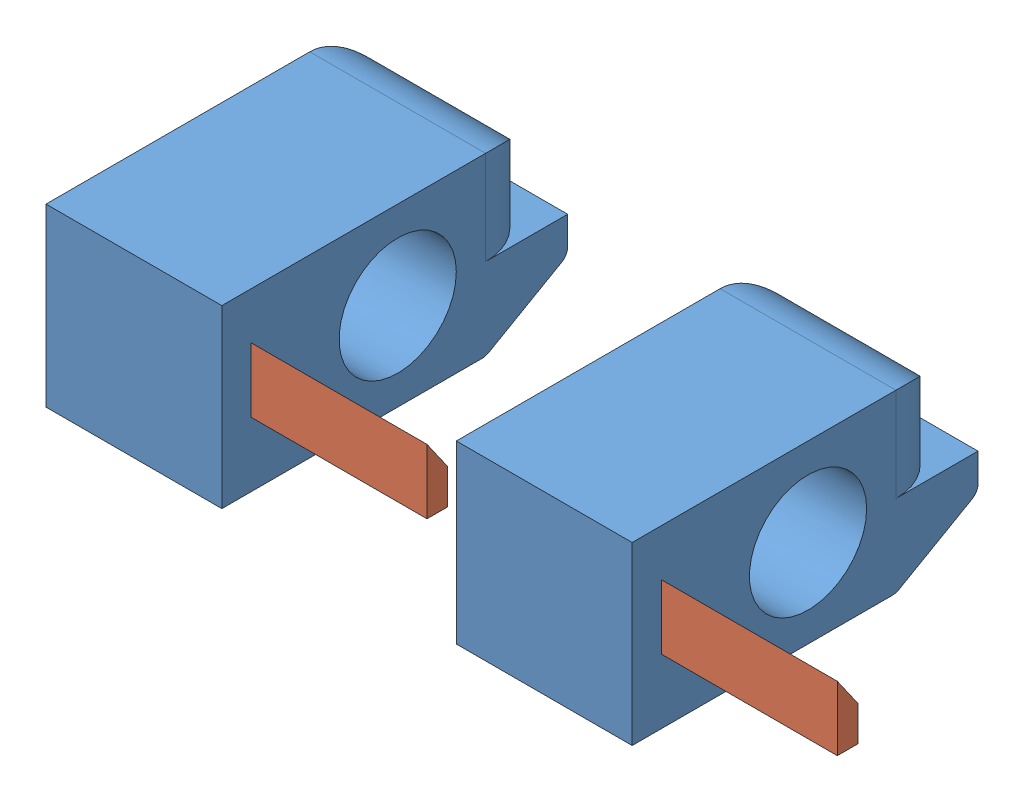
SolidWorks assembly linkageAssembly.SLDASM, configuration Default (file format 19000). Lengths in mm.
Overall size (13.5 3 5.9).
4 component instances, 2 part files, 9 mates.
Components (placement in the parent):
- oneLink-1: oneLink.SLDPRT [Default] at origin
- oneLink-6: oneLink.SLDPRT [Default] at (7 0 0)
- oneRamp-1: oneRamp.SLDPRT [Default] at (3.5 2.2 -0.35)
- oneRamp-2: oneRamp.SLDPRT [Default] at (10.5 2.2 -0.35)
Mates (geometry in assembly coordinates):
- Distance1: distance = 4 mm anti-aligned: plane of oneLink-1 through (3 3 -5.5) normal (1 0 0); plane of oneLink-6 through (7 3 0) normal (-1 0 0)
- Concentric1: concentric aligned: circle of oneLink-1; circle of oneLink-6
- Parallel1: parallel aligned: plane of oneLink-1 through (3 3 0) normal (0 0 1); plane of oneLink-6 through (10 3 0) normal (0 0 1)
- Coincident1: coincident: plane of oneLink-1 through (3 3 0) normal (0 0 1); plane of oneRamp-1 through (3.5 2.3048 0) normal (0 0 1)
- Distance2: distance = 0.5 mm: plane of oneRamp-1 through (3.5 1.6 0) normal (-1 0 0); plane of oneLink-1 through (3 3 -5.5) normal (1 0 0)
- Coincident6: coincident: plane of oneLink-6 through (10 3 0) normal (0 0 1); plane of oneRamp-2 through (10.5 2.4467 0) normal (0 0 1)
- Distance6: distance = 0.5 mm: plane of oneRamp-2 through (10.5 1.6 0) normal (-1 0 0); plane of oneLink-6 through (10 3 -5.5) normal (1 0 0)
- Distance16: distance = 0.2 mm anti-aligned: plane of oneRamp-2 through (13.5 1.6 0) normal (0 -1 0); plane of oneLink-6 through (7 1.4 0.002) normal (0 1 0)
- Distance17: distance = 0.2 mm anti-aligned: plane of oneRamp-1 through (6.5 1.6 0) normal (0 -1 0); plane of oneLink-1 through (0 1.4 0.002) normal (0 1 0)
